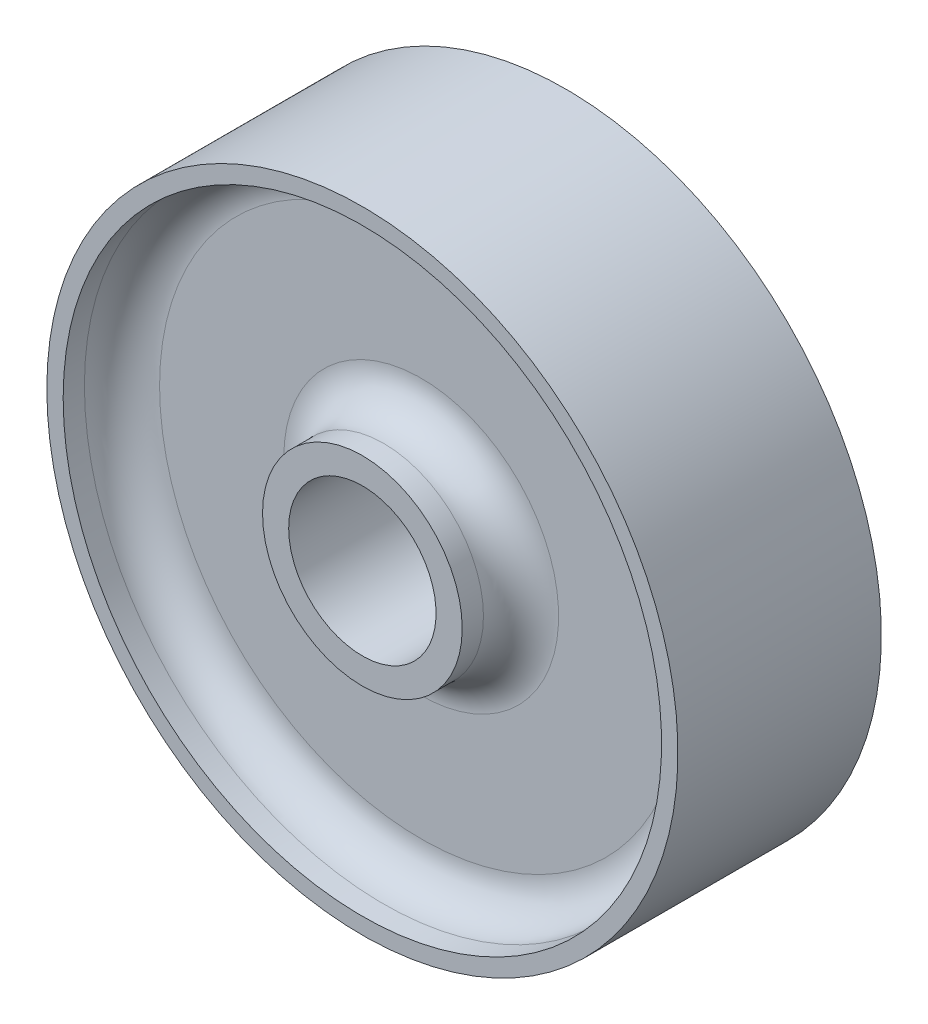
ISO-10303-21;
HEADER;
FILE_DESCRIPTION(('STEP AP214'),'2;1');
FILE_NAME('part.step','',(''),(''),'','','');
FILE_SCHEMA(('AUTOMOTIVE_DESIGN { 1 0 10303 214 1 1 1 1 }'));
ENDSEC;
DATA;
#1=APPLICATION_CONTEXT('core data for automotive mechanical design processes');
#2=APPLICATION_PROTOCOL_DEFINITION('international standard','automotive_design',2000,#1);
#3=PRODUCT_CONTEXT('',#1,'mechanical');
#4=PRODUCT('Part','Part','',(#3));
#5=PRODUCT_RELATED_PRODUCT_CATEGORY('part','',(#4));
#6=PRODUCT_DEFINITION_FORMATION('','',#4);
#7=PRODUCT_DEFINITION_CONTEXT('part definition',#1,'design');
#8=PRODUCT_DEFINITION('design','',#6,#7);
#9=PRODUCT_DEFINITION_SHAPE('','',#8);
#10=(LENGTH_UNIT() NAMED_UNIT(*) SI_UNIT(.MILLI.,.METRE.));
#11=(NAMED_UNIT(*) PLANE_ANGLE_UNIT() SI_UNIT($,.RADIAN.));
#12=(NAMED_UNIT(*) SI_UNIT($,.STERADIAN.) SOLID_ANGLE_UNIT());
#13=UNCERTAINTY_MEASURE_WITH_UNIT(LENGTH_MEASURE(1.E-05),#10,'distance_accuracy_value','');
#14=(GEOMETRIC_REPRESENTATION_CONTEXT(3) GLOBAL_UNCERTAINTY_ASSIGNED_CONTEXT((#13)) GLOBAL_UNIT_ASSIGNED_CONTEXT((#10,
#11,#12)) REPRESENTATION_CONTEXT('',''));
#15=CARTESIAN_POINT('',(0.,0.,0.));
#16=DIRECTION('',(0.,0.,1.));
#17=DIRECTION('',(1.,0.,0.));
#18=AXIS2_PLACEMENT_3D('',#15,#16,#17);
#19=CARTESIAN_POINT('',(0.,0.,0.));
#20=DIRECTION('',(0.,0.,-1.));
#21=DIRECTION('',(-1.,0.,0.));
#22=AXIS2_PLACEMENT_3D('',#19,#20,#21);
#23=CYLINDRICAL_SURFACE('',#22,11.4554);
#24=CARTESIAN_POINT('',(0.,0.,-15.8115));
#25=DIRECTION('',(0.,0.,-1.));
#26=DIRECTION('',(-1.,0.,0.));
#27=AXIS2_PLACEMENT_3D('',#24,#25,#26);
#28=CIRCLE('',#27,11.4554);
#29=CARTESIAN_POINT('',(-11.4554,0.,-15.8115));
#30=VERTEX_POINT('',#29);
#31=EDGE_CURVE('E55',#30,#30,#28,.F.);
#32=ORIENTED_EDGE('',*,*,#31,.F.);
#33=EDGE_LOOP('',(#32));
#34=FACE_BOUND('',#33,.T.);
#35=CARTESIAN_POINT('',(0.,0.,15.8115));
#36=DIRECTION('',(0.,0.,-1.));
#37=DIRECTION('',(-1.,0.,0.));
#38=AXIS2_PLACEMENT_3D('',#35,#36,#37);
#39=CIRCLE('',#38,11.4554);
#40=CARTESIAN_POINT('',(-11.4554,0.,15.8115));
#41=VERTEX_POINT('',#40);
#42=EDGE_CURVE('E20',#41,#41,#39,.T.);
#43=ORIENTED_EDGE('',*,*,#42,.F.);
#44=EDGE_LOOP('',(#43));
#45=FACE_BOUND('',#44,.T.);
#46=ADVANCED_FACE('F17',(#34,#45),#23,.F.);
#47=CARTESIAN_POINT('',(0.,11.4554,15.8115));
#48=DIRECTION('',(0.,0.,1.));
#49=DIRECTION('',(1.,0.,0.));
#50=AXIS2_PLACEMENT_3D('',#47,#48,#49);
#51=PLANE('',#50);
#52=ORIENTED_EDGE('',*,*,#42,.T.);
#53=EDGE_LOOP('',(#52));
#54=FACE_BOUND('',#53,.T.);
#55=CARTESIAN_POINT('',(0.,0.,15.8115));
#56=DIRECTION('',(0.,0.,-1.));
#57=DIRECTION('',(-1.,0.,0.));
#58=AXIS2_PLACEMENT_3D('',#55,#56,#57);
#59=CIRCLE('',#58,15.5194);
#60=CARTESIAN_POINT('',(-15.5194,0.,15.8115));
#61=VERTEX_POINT('',#60);
#62=EDGE_CURVE('E52',#61,#61,#59,.T.);
#63=ORIENTED_EDGE('',*,*,#62,.F.);
#64=EDGE_LOOP('',(#63));
#65=FACE_BOUND('',#64,.T.);
#66=ADVANCED_FACE('F65',(#54,#65),#51,.T.);
#67=CARTESIAN_POINT('',(0.,11.4554,-15.8115));
#68=DIRECTION('',(0.,0.,-1.));
#69=DIRECTION('',(-1.,0.,0.));
#70=AXIS2_PLACEMENT_3D('',#67,#68,#69);
#71=PLANE('',#70);
#72=ORIENTED_EDGE('',*,*,#31,.T.);
#73=EDGE_LOOP('',(#72));
#74=FACE_BOUND('',#73,.T.);
#75=CARTESIAN_POINT('',(0.,0.,-15.8115));
#76=DIRECTION('',(0.,0.,-1.));
#77=DIRECTION('',(-1.,0.,0.));
#78=AXIS2_PLACEMENT_3D('',#75,#76,#77);
#79=CIRCLE('',#78,15.5194);
#80=CARTESIAN_POINT('',(-15.5194,0.,-15.8115));
#81=VERTEX_POINT('',#80);
#82=EDGE_CURVE('E47',#81,#81,#79,.F.);
#83=ORIENTED_EDGE('',*,*,#82,.F.);
#84=EDGE_LOOP('',(#83));
#85=FACE_BOUND('',#84,.T.);
#86=ADVANCED_FACE('F75',(#74,#85),#71,.T.);
#87=CARTESIAN_POINT('',(0.,0.,0.));
#88=DIRECTION('',(0.,0.,-1.));
#89=DIRECTION('',(-1.,0.,0.));
#90=AXIS2_PLACEMENT_3D('',#87,#88,#89);
#91=CYLINDRICAL_SURFACE('',#90,15.5194);
#92=CARTESIAN_POINT('',(0.,0.,12.5095));
#93=DIRECTION('',(0.,0.,-1.));
#94=DIRECTION('',(-1.,0.,0.));
#95=AXIS2_PLACEMENT_3D('',#92,#93,#94);
#96=CIRCLE('',#95,15.5194);
#97=CARTESIAN_POINT('',(-15.5194,0.,12.5095));
#98=VERTEX_POINT('',#97);
#99=EDGE_CURVE('E51',#98,#98,#96,.F.);
#100=ORIENTED_EDGE('',*,*,#99,.T.);
#101=EDGE_LOOP('',(#100));
#102=FACE_BOUND('',#101,.T.);
#103=ORIENTED_EDGE('',*,*,#62,.T.);
#104=EDGE_LOOP('',(#103));
#105=FACE_BOUND('',#104,.T.);
#106=ADVANCED_FACE('F231',(#102,#105),#91,.T.);
#107=CARTESIAN_POINT('',(0.,0.,0.));
#108=DIRECTION('',(0.,0.,-1.));
#109=DIRECTION('',(-1.,0.,0.));
#110=AXIS2_PLACEMENT_3D('',#107,#108,#109);
#111=CYLINDRICAL_SURFACE('',#110,15.5194);
#112=ORIENTED_EDGE('',*,*,#82,.T.);
#113=EDGE_LOOP('',(#112));
#114=FACE_BOUND('',#113,.T.);
#115=CARTESIAN_POINT('',(0.,0.,-12.5095));
#116=DIRECTION('',(0.,0.,-1.));
#117=DIRECTION('',(-1.,0.,0.));
#118=AXIS2_PLACEMENT_3D('',#115,#116,#117);
#119=CIRCLE('',#118,15.5194);
#120=CARTESIAN_POINT('',(-15.5194,0.,-12.5095));
#121=VERTEX_POINT('',#120);
#122=EDGE_CURVE('E195',#121,#121,#119,.T.);
#123=ORIENTED_EDGE('',*,*,#122,.T.);
#124=EDGE_LOOP('',(#123));
#125=FACE_BOUND('',#124,.T.);
#126=ADVANCED_FACE('F228',(#114,#125),#111,.T.);
#127=CARTESIAN_POINT('',(0.,0.,12.5095));
#128=DIRECTION('',(0.,0.,-1.));
#129=DIRECTION('',(-1.,0.,0.));
#130=AXIS2_PLACEMENT_3D('',#127,#128,#129);
#131=TOROIDAL_SURFACE('',#130,21.3614,5.842);
#132=ORIENTED_EDGE('',*,*,#99,.F.);
#133=EDGE_LOOP('',(#132));
#134=FACE_BOUND('',#133,.T.);
#135=CARTESIAN_POINT('',(0.,0.,6.6675));
#136=DIRECTION('',(0.,0.,1.));
#137=DIRECTION('',(-1.,0.,0.));
#138=AXIS2_PLACEMENT_3D('',#135,#136,#137);
#139=CIRCLE('',#138,21.3614);
#140=CARTESIAN_POINT('',(-21.3614,0.,6.6675));
#141=VERTEX_POINT('',#140);
#142=EDGE_CURVE('E174',#141,#141,#139,.F.);
#143=ORIENTED_EDGE('',*,*,#142,.F.);
#144=EDGE_LOOP('',(#143));
#145=FACE_BOUND('',#144,.T.);
#146=ADVANCED_FACE('F199',(#134,#145),#131,.F.);
#147=CARTESIAN_POINT('',(0.,0.,-12.5095));
#148=DIRECTION('',(0.,0.,-1.));
#149=DIRECTION('',(-1.,0.,0.));
#150=AXIS2_PLACEMENT_3D('',#147,#148,#149);
#151=TOROIDAL_SURFACE('',#150,21.3614,5.842);
#152=CARTESIAN_POINT('',(0.,0.,-6.6675));
#153=DIRECTION('',(0.,0.,-1.));
#154=DIRECTION('',(-1.,0.,0.));
#155=AXIS2_PLACEMENT_3D('',#152,#153,#154);
#156=CIRCLE('',#155,21.3614);
#157=CARTESIAN_POINT('',(-21.3614,0.,-6.6675));
#158=VERTEX_POINT('',#157);
#159=EDGE_CURVE('E221',#158,#158,#156,.F.);
#160=ORIENTED_EDGE('',*,*,#159,.F.);
#161=EDGE_LOOP('',(#160));
#162=FACE_BOUND('',#161,.T.);
#163=ORIENTED_EDGE('',*,*,#122,.F.);
#164=EDGE_LOOP('',(#163));
#165=FACE_BOUND('',#164,.T.);
#166=ADVANCED_FACE('F197',(#162,#165),#151,.F.);
#167=CARTESIAN_POINT('',(0.,21.3614,6.6675));
#168=DIRECTION('',(0.,0.,1.));
#169=DIRECTION('',(1.,0.,0.));
#170=AXIS2_PLACEMENT_3D('',#167,#168,#169);
#171=PLANE('',#170);
#172=ORIENTED_EDGE('',*,*,#142,.T.);
#173=EDGE_LOOP('',(#172));
#174=FACE_BOUND('',#173,.T.);
#175=CARTESIAN_POINT('',(0.,0.,6.6675));
#176=DIRECTION('',(0.,0.,-1.));
#177=DIRECTION('',(-1.,0.,0.));
#178=AXIS2_PLACEMENT_3D('',#175,#176,#177);
#179=CIRCLE('',#178,40.6654);
#180=CARTESIAN_POINT('',(-40.6654,0.,6.6675));
#181=VERTEX_POINT('',#180);
#182=EDGE_CURVE('E161',#181,#181,#179,.F.);
#183=ORIENTED_EDGE('',*,*,#182,.T.);
#184=EDGE_LOOP('',(#183));
#185=FACE_BOUND('',#184,.T.);
#186=ADVANCED_FACE('F135',(#174,#185),#171,.T.);
#187=CARTESIAN_POINT('',(0.,21.3614,-6.6675));
#188=DIRECTION('',(0.,0.,-1.));
#189=DIRECTION('',(-1.,0.,0.));
#190=AXIS2_PLACEMENT_3D('',#187,#188,#189);
#191=PLANE('',#190);
#192=ORIENTED_EDGE('',*,*,#159,.T.);
#193=EDGE_LOOP('',(#192));
#194=FACE_BOUND('',#193,.T.);
#195=CARTESIAN_POINT('',(0.,0.,-6.6675));
#196=DIRECTION('',(0.,0.,1.));
#197=DIRECTION('',(-1.,0.,0.));
#198=AXIS2_PLACEMENT_3D('',#195,#196,#197);
#199=CIRCLE('',#198,40.6654);
#200=CARTESIAN_POINT('',(-40.6654,0.,-6.6675));
#201=VERTEX_POINT('',#200);
#202=EDGE_CURVE('E120',#201,#201,#199,.F.);
#203=ORIENTED_EDGE('',*,*,#202,.T.);
#204=EDGE_LOOP('',(#203));
#205=FACE_BOUND('',#204,.T.);
#206=ADVANCED_FACE('F126',(#194,#205),#191,.T.);
#207=CARTESIAN_POINT('',(0.,0.,12.5095));
#208=DIRECTION('',(0.,0.,-1.));
#209=DIRECTION('',(-1.,0.,0.));
#210=AXIS2_PLACEMENT_3D('',#207,#208,#209);
#211=TOROIDAL_SURFACE('',#210,40.6654,5.842);
#212=ORIENTED_EDGE('',*,*,#182,.F.);
#213=EDGE_LOOP('',(#212));
#214=FACE_BOUND('',#213,.T.);
#215=CARTESIAN_POINT('',(0.,0.,12.5095));
#216=DIRECTION('',(0.,0.,-1.));
#217=DIRECTION('',(-1.,0.,0.));
#218=AXIS2_PLACEMENT_3D('',#215,#216,#217);
#219=CIRCLE('',#218,46.5074);
#220=CARTESIAN_POINT('',(-46.5074,0.,12.5095));
#221=VERTEX_POINT('',#220);
#222=EDGE_CURVE('E316',#221,#221,#219,.F.);
#223=ORIENTED_EDGE('',*,*,#222,.T.);
#224=EDGE_LOOP('',(#223));
#225=FACE_BOUND('',#224,.T.);
#226=ADVANCED_FACE('F104',(#214,#225),#211,.F.);
#227=CARTESIAN_POINT('',(0.,0.,-12.5095));
#228=DIRECTION('',(0.,0.,-1.));
#229=DIRECTION('',(-1.,0.,0.));
#230=AXIS2_PLACEMENT_3D('',#227,#228,#229);
#231=TOROIDAL_SURFACE('',#230,40.6654,5.842);
#232=CARTESIAN_POINT('',(0.,0.,-12.5095));
#233=DIRECTION('',(0.,0.,-1.));
#234=DIRECTION('',(-1.,0.,0.));
#235=AXIS2_PLACEMENT_3D('',#232,#233,#234);
#236=CIRCLE('',#235,46.5074);
#237=CARTESIAN_POINT('',(-46.5074,0.,-12.5095));
#238=VERTEX_POINT('',#237);
#239=EDGE_CURVE('E46',#238,#238,#236,.T.);
#240=ORIENTED_EDGE('',*,*,#239,.T.);
#241=EDGE_LOOP('',(#240));
#242=FACE_BOUND('',#241,.T.);
#243=ORIENTED_EDGE('',*,*,#202,.F.);
#244=EDGE_LOOP('',(#243));
#245=FACE_BOUND('',#244,.T.);
#246=ADVANCED_FACE('F99',(#242,#245),#231,.F.);
#247=CARTESIAN_POINT('',(0.,0.,0.));
#248=DIRECTION('',(0.,0.,-1.));
#249=DIRECTION('',(-1.,0.,0.));
#250=AXIS2_PLACEMENT_3D('',#247,#248,#249);
#251=CYLINDRICAL_SURFACE('',#250,46.5074);
#252=ORIENTED_EDGE('',*,*,#222,.F.);
#253=EDGE_LOOP('',(#252));
#254=FACE_BOUND('',#253,.T.);
#255=CARTESIAN_POINT('',(0.,0.,15.8115));
#256=DIRECTION('',(0.,0.,-1.));
#257=DIRECTION('',(-1.,0.,0.));
#258=AXIS2_PLACEMENT_3D('',#255,#256,#257);
#259=CIRCLE('',#258,46.5074);
#260=CARTESIAN_POINT('',(-46.5074,0.,15.8115));
#261=VERTEX_POINT('',#260);
#262=EDGE_CURVE('E43',#261,#261,#259,.T.);
#263=ORIENTED_EDGE('',*,*,#262,.F.);
#264=EDGE_LOOP('',(#263));
#265=FACE_BOUND('',#264,.T.);
#266=ADVANCED_FACE('F95',(#254,#265),#251,.F.);
#267=CARTESIAN_POINT('',(0.,0.,0.));
#268=DIRECTION('',(0.,0.,-1.));
#269=DIRECTION('',(-1.,0.,0.));
#270=AXIS2_PLACEMENT_3D('',#267,#268,#269);
#271=CYLINDRICAL_SURFACE('',#270,46.5074);
#272=CARTESIAN_POINT('',(0.,0.,-15.8115));
#273=DIRECTION('',(0.,0.,-1.));
#274=DIRECTION('',(-1.,0.,0.));
#275=AXIS2_PLACEMENT_3D('',#272,#273,#274);
#276=CIRCLE('',#275,46.5074);
#277=CARTESIAN_POINT('',(-46.5074,0.,-15.8115));
#278=VERTEX_POINT('',#277);
#279=EDGE_CURVE('E33',#278,#278,#276,.F.);
#280=ORIENTED_EDGE('',*,*,#279,.F.);
#281=EDGE_LOOP('',(#280));
#282=FACE_BOUND('',#281,.T.);
#283=ORIENTED_EDGE('',*,*,#239,.F.);
#284=EDGE_LOOP('',(#283));
#285=FACE_BOUND('',#284,.T.);
#286=ADVANCED_FACE('F91',(#282,#285),#271,.F.);
#287=CARTESIAN_POINT('',(0.,46.5074,15.8115));
#288=DIRECTION('',(0.,0.,1.));
#289=DIRECTION('',(1.,0.,0.));
#290=AXIS2_PLACEMENT_3D('',#287,#288,#289);
#291=PLANE('',#290);
#292=ORIENTED_EDGE('',*,*,#262,.T.);
#293=EDGE_LOOP('',(#292));
#294=FACE_BOUND('',#293,.T.);
#295=CARTESIAN_POINT('',(0.,0.,15.8115));
#296=DIRECTION('',(0.,0.,-1.));
#297=DIRECTION('',(-1.,0.,0.));
#298=AXIS2_PLACEMENT_3D('',#295,#296,#297);
#299=CIRCLE('',#298,49.0474);
#300=CARTESIAN_POINT('',(-49.0474,0.,15.8115));
#301=VERTEX_POINT('',#300);
#302=EDGE_CURVE('E25',#301,#301,#299,.T.);
#303=ORIENTED_EDGE('',*,*,#302,.F.);
#304=EDGE_LOOP('',(#303));
#305=FACE_BOUND('',#304,.T.);
#306=ADVANCED_FACE('F84',(#294,#305),#291,.T.);
#307=CARTESIAN_POINT('',(0.,46.5074,-15.8115));
#308=DIRECTION('',(0.,0.,-1.));
#309=DIRECTION('',(-1.,0.,0.));
#310=AXIS2_PLACEMENT_3D('',#307,#308,#309);
#311=PLANE('',#310);
#312=ORIENTED_EDGE('',*,*,#279,.T.);
#313=EDGE_LOOP('',(#312));
#314=FACE_BOUND('',#313,.T.);
#315=CARTESIAN_POINT('',(0.,0.,-15.8115));
#316=DIRECTION('',(0.,0.,-1.));
#317=DIRECTION('',(-1.,0.,0.));
#318=AXIS2_PLACEMENT_3D('',#315,#316,#317);
#319=CIRCLE('',#318,49.0474);
#320=CARTESIAN_POINT('',(-49.0474,0.,-15.8115));
#321=VERTEX_POINT('',#320);
#322=EDGE_CURVE('E10',#321,#321,#319,.F.);
#323=ORIENTED_EDGE('',*,*,#322,.F.);
#324=EDGE_LOOP('',(#323));
#325=FACE_BOUND('',#324,.T.);
#326=ADVANCED_FACE('F78',(#314,#325),#311,.T.);
#327=CARTESIAN_POINT('',(0.,0.,0.));
#328=DIRECTION('',(0.,0.,-1.));
#329=DIRECTION('',(-1.,0.,0.));
#330=AXIS2_PLACEMENT_3D('',#327,#328,#329);
#331=CYLINDRICAL_SURFACE('',#330,49.0474);
#332=ORIENTED_EDGE('',*,*,#322,.T.);
#333=EDGE_LOOP('',(#332));
#334=FACE_BOUND('',#333,.T.);
#335=ORIENTED_EDGE('',*,*,#302,.T.);
#336=EDGE_LOOP('',(#335));
#337=FACE_BOUND('',#336,.T.);
#338=ADVANCED_FACE('F76',(#334,#337),#331,.T.);
#339=CLOSED_SHELL('',(#46,#66,#86,#106,#126,#146,#166,#186,#206,#226,#246,#266,#286,#306,#326,#338));
#340=MANIFOLD_SOLID_BREP('B1',#339);
#341=ADVANCED_BREP_SHAPE_REPRESENTATION('',(#18,#340),#14);
#342=SHAPE_DEFINITION_REPRESENTATION(#9,#341);
ENDSEC;
END-ISO-10303-21;
